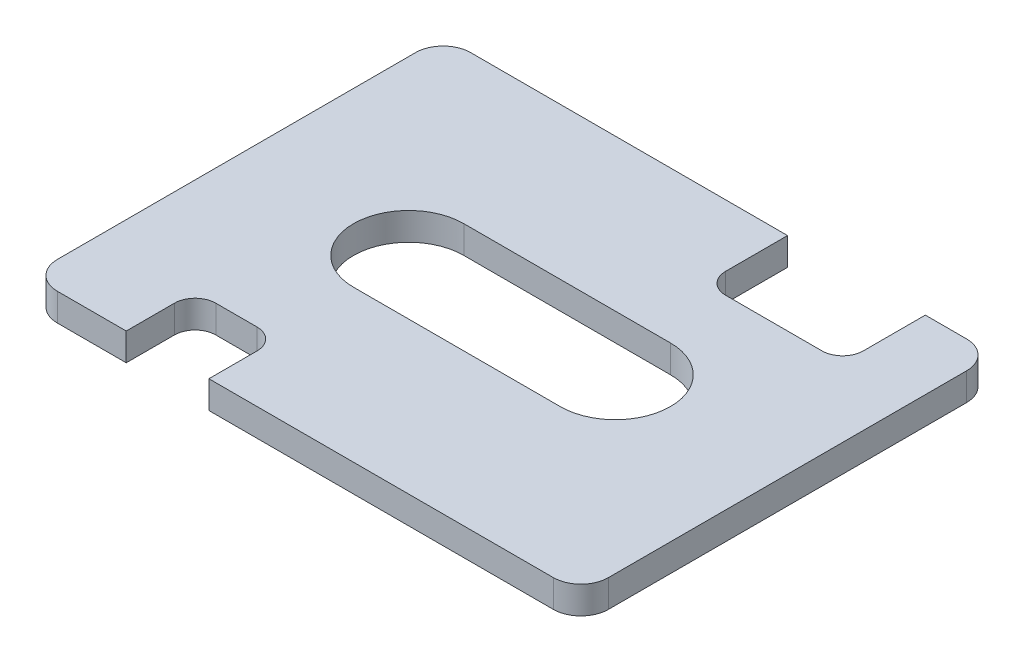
ISO-10303-21;
HEADER;
FILE_DESCRIPTION(('STEP AP214'),'2;1');
FILE_NAME('part.step','',(''),(''),'','','');
FILE_SCHEMA(('AUTOMOTIVE_DESIGN { 1 0 10303 214 1 1 1 1 }'));
ENDSEC;
DATA;
#1=APPLICATION_CONTEXT('core data for automotive mechanical design processes');
#2=APPLICATION_PROTOCOL_DEFINITION('international standard','automotive_design',2000,#1);
#3=PRODUCT_CONTEXT('',#1,'mechanical');
#4=PRODUCT('Part','Part','',(#3));
#5=PRODUCT_RELATED_PRODUCT_CATEGORY('part','',(#4));
#6=PRODUCT_DEFINITION_FORMATION('','',#4);
#7=PRODUCT_DEFINITION_CONTEXT('part definition',#1,'design');
#8=PRODUCT_DEFINITION('design','',#6,#7);
#9=PRODUCT_DEFINITION_SHAPE('','',#8);
#10=(LENGTH_UNIT() NAMED_UNIT(*) SI_UNIT(.MILLI.,.METRE.));
#11=(NAMED_UNIT(*) PLANE_ANGLE_UNIT() SI_UNIT($,.RADIAN.));
#12=(NAMED_UNIT(*) SI_UNIT($,.STERADIAN.) SOLID_ANGLE_UNIT());
#13=UNCERTAINTY_MEASURE_WITH_UNIT(LENGTH_MEASURE(1.E-05),#10,'distance_accuracy_value','');
#14=(GEOMETRIC_REPRESENTATION_CONTEXT(3) GLOBAL_UNCERTAINTY_ASSIGNED_CONTEXT((#13)) GLOBAL_UNIT_ASSIGNED_CONTEXT((#10,
#11,#12)) REPRESENTATION_CONTEXT('',''));
#15=CARTESIAN_POINT('',(0.,0.,0.));
#16=DIRECTION('',(0.,0.,1.));
#17=DIRECTION('',(1.,0.,0.));
#18=AXIS2_PLACEMENT_3D('',#15,#16,#17);
#19=CARTESIAN_POINT('',(-100.,10.,-75.));
#20=DIRECTION('',(0.,0.,1.));
#21=DIRECTION('',(1.,0.,0.));
#22=AXIS2_PLACEMENT_3D('',#19,#20,#21);
#23=PLANE('',#22);
#24=DIRECTION('',(-1.,0.,0.));
#25=VECTOR('',#24,1.);
#26=CARTESIAN_POINT('',(-100.,0.,-75.));
#27=LINE('',#26,#25);
#28=CARTESIAN_POINT('',(25.,0.,-75.));
#29=VERTEX_POINT('',#28);
#30=CARTESIAN_POINT('',(-90.,0.,-75.));
#31=VERTEX_POINT('',#30);
#32=EDGE_CURVE('E516',#29,#31,#27,.T.);
#33=ORIENTED_EDGE('',*,*,#32,.T.);
#34=DIRECTION('',(0.,-1.,0.));
#35=VECTOR('',#34,1.);
#36=CARTESIAN_POINT('',(-90.,10.,-75.));
#37=LINE('',#36,#35);
#38=CARTESIAN_POINT('',(-90.,10.,-75.));
#39=VERTEX_POINT('',#38);
#40=EDGE_CURVE('E442',#31,#39,#37,.F.);
#41=ORIENTED_EDGE('',*,*,#40,.T.);
#42=DIRECTION('',(-1.,0.,0.));
#43=VECTOR('',#42,1.);
#44=CARTESIAN_POINT('',(-100.,10.,-75.));
#45=LINE('',#44,#43);
#46=CARTESIAN_POINT('',(25.,10.,-75.));
#47=VERTEX_POINT('',#46);
#48=EDGE_CURVE('E410',#47,#39,#45,.T.);
#49=ORIENTED_EDGE('',*,*,#48,.F.);
#50=DIRECTION('',(0.,-1.,0.));
#51=VECTOR('',#50,1.);
#52=CARTESIAN_POINT('',(25.,10.,-75.));
#53=LINE('',#52,#51);
#54=EDGE_CURVE('E301',#47,#29,#53,.T.);
#55=ORIENTED_EDGE('',*,*,#54,.T.);
#56=EDGE_LOOP('',(#33,#41,#49,#55));
#57=FACE_BOUND('',#56,.T.);
#58=ADVANCED_FACE('F41',(#57),#23,.F.);
#59=CARTESIAN_POINT('',(-100.,10.,75.));
#60=DIRECTION('',(0.,0.,-1.));
#61=DIRECTION('',(-1.,0.,0.));
#62=AXIS2_PLACEMENT_3D('',#59,#60,#61);
#63=PLANE('',#62);
#64=DIRECTION('',(1.,0.,0.));
#65=VECTOR('',#64,1.);
#66=CARTESIAN_POINT('',(-100.,0.,75.));
#67=LINE('',#66,#65);
#68=CARTESIAN_POINT('',(-35.,0.,75.));
#69=VERTEX_POINT('',#68);
#70=CARTESIAN_POINT('',(90.,0.,75.));
#71=VERTEX_POINT('',#70);
#72=EDGE_CURVE('E429',#69,#71,#67,.T.);
#73=ORIENTED_EDGE('',*,*,#72,.T.);
#74=DIRECTION('',(0.,-1.,0.));
#75=VECTOR('',#74,1.);
#76=CARTESIAN_POINT('',(90.,10.,75.));
#77=LINE('',#76,#75);
#78=CARTESIAN_POINT('',(90.,10.,75.));
#79=VERTEX_POINT('',#78);
#80=EDGE_CURVE('E51',#71,#79,#77,.F.);
#81=ORIENTED_EDGE('',*,*,#80,.T.);
#82=DIRECTION('',(1.,0.,0.));
#83=VECTOR('',#82,1.);
#84=CARTESIAN_POINT('',(-100.,10.,75.));
#85=LINE('',#84,#83);
#86=CARTESIAN_POINT('',(-35.,10.,75.));
#87=VERTEX_POINT('',#86);
#88=EDGE_CURVE('E427',#87,#79,#85,.T.);
#89=ORIENTED_EDGE('',*,*,#88,.F.);
#90=DIRECTION('',(0.,-1.,0.));
#91=VECTOR('',#90,1.);
#92=CARTESIAN_POINT('',(-35.,10.,75.));
#93=LINE('',#92,#91);
#94=EDGE_CURVE('E498',#87,#69,#93,.T.);
#95=ORIENTED_EDGE('',*,*,#94,.T.);
#96=EDGE_LOOP('',(#73,#81,#89,#95));
#97=FACE_BOUND('',#96,.T.);
#98=ADVANCED_FACE('F379',(#97),#63,.F.);
#99=CARTESIAN_POINT('',(100.,10.,75.));
#100=DIRECTION('',(-1.,0.,0.));
#101=DIRECTION('',(0.,0.,1.));
#102=AXIS2_PLACEMENT_3D('',#99,#100,#101);
#103=PLANE('',#102);
#104=DIRECTION('',(0.,0.,-1.));
#105=VECTOR('',#104,1.);
#106=CARTESIAN_POINT('',(100.,0.,75.));
#107=LINE('',#106,#105);
#108=CARTESIAN_POINT('',(100.,0.,65.));
#109=VERTEX_POINT('',#108);
#110=CARTESIAN_POINT('',(100.,0.,-65.));
#111=VERTEX_POINT('',#110);
#112=EDGE_CURVE('E502',#109,#111,#107,.T.);
#113=ORIENTED_EDGE('',*,*,#112,.T.);
#114=DIRECTION('',(0.,-1.,0.));
#115=VECTOR('',#114,1.);
#116=CARTESIAN_POINT('',(100.,10.,-65.));
#117=LINE('',#116,#115);
#118=CARTESIAN_POINT('',(100.,10.,-65.));
#119=VERTEX_POINT('',#118);
#120=EDGE_CURVE('E66',#111,#119,#117,.F.);
#121=ORIENTED_EDGE('',*,*,#120,.T.);
#122=DIRECTION('',(0.,0.,-1.));
#123=VECTOR('',#122,1.);
#124=CARTESIAN_POINT('',(100.,10.,75.));
#125=LINE('',#124,#123);
#126=CARTESIAN_POINT('',(100.,10.,65.));
#127=VERTEX_POINT('',#126);
#128=EDGE_CURVE('E503',#127,#119,#125,.T.);
#129=ORIENTED_EDGE('',*,*,#128,.F.);
#130=DIRECTION('',(0.,-1.,0.));
#131=VECTOR('',#130,1.);
#132=CARTESIAN_POINT('',(100.,10.,65.));
#133=LINE('',#132,#131);
#134=EDGE_CURVE('E414',#127,#109,#133,.T.);
#135=ORIENTED_EDGE('',*,*,#134,.T.);
#136=EDGE_LOOP('',(#113,#121,#129,#135));
#137=FACE_BOUND('',#136,.T.);
#138=ADVANCED_FACE('F386',(#137),#103,.F.);
#139=CARTESIAN_POINT('',(90.,10.,-75.));
#140=VERTEX_POINT('',#139);
#141=CARTESIAN_POINT('',(75.,10.,-75.));
#142=VERTEX_POINT('',#141);
#143=EDGE_CURVE('E402',#140,#142,#45,.T.);
#144=ORIENTED_EDGE('',*,*,#143,.F.);
#145=DIRECTION('',(0.,-1.,0.));
#146=VECTOR('',#145,1.);
#147=CARTESIAN_POINT('',(90.,10.,-75.));
#148=LINE('',#147,#146);
#149=CARTESIAN_POINT('',(90.,0.,-75.));
#150=VERTEX_POINT('',#149);
#151=EDGE_CURVE('E404',#140,#150,#148,.T.);
#152=ORIENTED_EDGE('',*,*,#151,.T.);
#153=CARTESIAN_POINT('',(75.,0.,-75.));
#154=VERTEX_POINT('',#153);
#155=EDGE_CURVE('E517',#150,#154,#27,.T.);
#156=ORIENTED_EDGE('',*,*,#155,.T.);
#157=DIRECTION('',(0.,1.,0.));
#158=VECTOR('',#157,1.);
#159=CARTESIAN_POINT('',(75.,10.,-75.));
#160=LINE('',#159,#158);
#161=EDGE_CURVE('E264',#154,#142,#160,.T.);
#162=ORIENTED_EDGE('',*,*,#161,.T.);
#163=EDGE_LOOP('',(#144,#152,#156,#162));
#164=FACE_BOUND('',#163,.T.);
#165=ADVANCED_FACE('F382',(#164),#23,.F.);
#166=CARTESIAN_POINT('',(-100.,10.,75.));
#167=DIRECTION('',(1.,0.,0.));
#168=DIRECTION('',(0.,0.,-1.));
#169=AXIS2_PLACEMENT_3D('',#166,#167,#168);
#170=PLANE('',#169);
#171=DIRECTION('',(0.,0.,1.));
#172=VECTOR('',#171,1.);
#173=CARTESIAN_POINT('',(-100.,10.,75.));
#174=LINE('',#173,#172);
#175=CARTESIAN_POINT('',(-100.,10.,-65.));
#176=VERTEX_POINT('',#175);
#177=CARTESIAN_POINT('',(-100.,10.,65.));
#178=VERTEX_POINT('',#177);
#179=EDGE_CURVE('E409',#176,#178,#174,.T.);
#180=ORIENTED_EDGE('',*,*,#179,.F.);
#181=DIRECTION('',(0.,-1.,0.));
#182=VECTOR('',#181,1.);
#183=CARTESIAN_POINT('',(-100.,10.,-65.));
#184=LINE('',#183,#182);
#185=CARTESIAN_POINT('',(-100.,0.,-65.));
#186=VERTEX_POINT('',#185);
#187=EDGE_CURVE('E453',#176,#186,#184,.T.);
#188=ORIENTED_EDGE('',*,*,#187,.T.);
#189=DIRECTION('',(0.,0.,1.));
#190=VECTOR('',#189,1.);
#191=CARTESIAN_POINT('',(-100.,0.,75.));
#192=LINE('',#191,#190);
#193=CARTESIAN_POINT('',(-100.,0.,65.));
#194=VERTEX_POINT('',#193);
#195=EDGE_CURVE('E519',#186,#194,#192,.T.);
#196=ORIENTED_EDGE('',*,*,#195,.T.);
#197=DIRECTION('',(0.,-1.,0.));
#198=VECTOR('',#197,1.);
#199=CARTESIAN_POINT('',(-100.,10.,65.));
#200=LINE('',#199,#198);
#201=EDGE_CURVE('E455',#194,#178,#200,.F.);
#202=ORIENTED_EDGE('',*,*,#201,.T.);
#203=EDGE_LOOP('',(#180,#188,#196,#202));
#204=FACE_BOUND('',#203,.T.);
#205=ADVANCED_FACE('F394',(#204),#170,.F.);
#206=CARTESIAN_POINT('',(-90.,10.,75.));
#207=VERTEX_POINT('',#206);
#208=CARTESIAN_POINT('',(-65.,10.,75.));
#209=VERTEX_POINT('',#208);
#210=EDGE_CURVE('E436',#207,#209,#85,.T.);
#211=ORIENTED_EDGE('',*,*,#210,.F.);
#212=DIRECTION('',(0.,-1.,0.));
#213=VECTOR('',#212,1.);
#214=CARTESIAN_POINT('',(-90.,10.,75.));
#215=LINE('',#214,#213);
#216=CARTESIAN_POINT('',(-90.,0.,75.));
#217=VERTEX_POINT('',#216);
#218=EDGE_CURVE('E12',#207,#217,#215,.T.);
#219=ORIENTED_EDGE('',*,*,#218,.T.);
#220=CARTESIAN_POINT('',(-65.,0.,75.));
#221=VERTEX_POINT('',#220);
#222=EDGE_CURVE('E505',#217,#221,#67,.T.);
#223=ORIENTED_EDGE('',*,*,#222,.T.);
#224=DIRECTION('',(0.,1.,0.));
#225=VECTOR('',#224,1.);
#226=CARTESIAN_POINT('',(-65.,10.,75.));
#227=LINE('',#226,#225);
#228=EDGE_CURVE('E477',#221,#209,#227,.T.);
#229=ORIENTED_EDGE('',*,*,#228,.T.);
#230=EDGE_LOOP('',(#211,#219,#223,#229));
#231=FACE_BOUND('',#230,.T.);
#232=ADVANCED_FACE('F389',(#231),#63,.F.);
#233=CARTESIAN_POINT('',(0.,10.,0.));
#234=DIRECTION('',(0.,-1.,0.));
#235=DIRECTION('',(0.,0.,-1.));
#236=AXIS2_PLACEMENT_3D('',#233,#234,#235);
#237=PLANE('',#236);
#238=DIRECTION('',(1.,0.,0.));
#239=VECTOR('',#238,1.);
#240=CARTESIAN_POINT('',(-37.5,10.,20.));
#241=LINE('',#240,#239);
#242=CARTESIAN_POINT('',(-37.5,10.,20.));
#243=VERTEX_POINT('',#242);
#244=CARTESIAN_POINT('',(37.5,10.,20.));
#245=VERTEX_POINT('',#244);
#246=EDGE_CURVE('E351',#243,#245,#241,.T.);
#247=ORIENTED_EDGE('',*,*,#246,.F.);
#248=CARTESIAN_POINT('',(-37.5,10.,0.));
#249=DIRECTION('',(0.,1.,0.));
#250=DIRECTION('',(0.,0.,1.));
#251=AXIS2_PLACEMENT_3D('',#248,#249,#250);
#252=CIRCLE('',#251,20.);
#253=CARTESIAN_POINT('',(-37.5,10.,-20.));
#254=VERTEX_POINT('',#253);
#255=EDGE_CURVE('E213',#254,#243,#252,.T.);
#256=ORIENTED_EDGE('',*,*,#255,.F.);
#257=DIRECTION('',(-1.,0.,0.));
#258=VECTOR('',#257,1.);
#259=CARTESIAN_POINT('',(-37.5,10.,-20.));
#260=LINE('',#259,#258);
#261=CARTESIAN_POINT('',(37.5,10.,-20.));
#262=VERTEX_POINT('',#261);
#263=EDGE_CURVE('E232',#262,#254,#260,.T.);
#264=ORIENTED_EDGE('',*,*,#263,.F.);
#265=CARTESIAN_POINT('',(37.5,10.,0.));
#266=DIRECTION('',(0.,1.,0.));
#267=DIRECTION('',(0.,0.,1.));
#268=AXIS2_PLACEMENT_3D('',#265,#266,#267);
#269=CIRCLE('',#268,20.);
#270=EDGE_CURVE('E238',#245,#262,#269,.T.);
#271=ORIENTED_EDGE('',*,*,#270,.F.);
#272=EDGE_LOOP('',(#247,#256,#264,#271));
#273=FACE_BOUND('',#272,.T.);
#274=ORIENTED_EDGE('',*,*,#48,.T.);
#275=CARTESIAN_POINT('',(-90.,10.,-65.));
#276=DIRECTION('',(0.,-1.,0.));
#277=DIRECTION('',(0.,0.,-1.));
#278=AXIS2_PLACEMENT_3D('',#275,#276,#277);
#279=CIRCLE('',#278,10.);
#280=EDGE_CURVE('E415',#39,#176,#279,.F.);
#281=ORIENTED_EDGE('',*,*,#280,.T.);
#282=ORIENTED_EDGE('',*,*,#179,.T.);
#283=CARTESIAN_POINT('',(-90.,10.,65.));
#284=DIRECTION('',(0.,-1.,0.));
#285=DIRECTION('',(0.,0.,-1.));
#286=AXIS2_PLACEMENT_3D('',#283,#284,#285);
#287=CIRCLE('',#286,10.);
#288=EDGE_CURVE('E440',#178,#207,#287,.F.);
#289=ORIENTED_EDGE('',*,*,#288,.T.);
#290=ORIENTED_EDGE('',*,*,#210,.T.);
#291=DIRECTION('',(0.,0.,1.));
#292=VECTOR('',#291,1.);
#293=CARTESIAN_POINT('',(-65.,10.,100.));
#294=LINE('',#293,#292);
#295=CARTESIAN_POINT('',(-65.,10.,57.5));
#296=VERTEX_POINT('',#295);
#297=EDGE_CURVE('E312',#296,#209,#294,.T.);
#298=ORIENTED_EDGE('',*,*,#297,.F.);
#299=CARTESIAN_POINT('',(-57.5,10.,57.5));
#300=DIRECTION('',(0.,-1.,0.));
#301=DIRECTION('',(0.,0.,-1.));
#302=AXIS2_PLACEMENT_3D('',#299,#300,#301);
#303=CIRCLE('',#302,7.5);
#304=CARTESIAN_POINT('',(-57.5,10.,50.));
#305=VERTEX_POINT('',#304);
#306=EDGE_CURVE('E329',#296,#305,#303,.T.);
#307=ORIENTED_EDGE('',*,*,#306,.T.);
#308=DIRECTION('',(-1.,0.,0.));
#309=VECTOR('',#308,1.);
#310=CARTESIAN_POINT('',(-65.,10.,50.));
#311=LINE('',#310,#309);
#312=CARTESIAN_POINT('',(-42.5,10.,50.));
#313=VERTEX_POINT('',#312);
#314=EDGE_CURVE('E566',#313,#305,#311,.T.);
#315=ORIENTED_EDGE('',*,*,#314,.F.);
#316=CARTESIAN_POINT('',(-42.5,10.,57.5));
#317=DIRECTION('',(0.,-1.,0.));
#318=DIRECTION('',(0.,0.,-1.));
#319=AXIS2_PLACEMENT_3D('',#316,#317,#318);
#320=CIRCLE('',#319,7.5);
#321=CARTESIAN_POINT('',(-35.,10.,57.5));
#322=VERTEX_POINT('',#321);
#323=EDGE_CURVE('E321',#313,#322,#320,.T.);
#324=ORIENTED_EDGE('',*,*,#323,.T.);
#325=DIRECTION('',(0.,0.,-1.));
#326=VECTOR('',#325,1.);
#327=CARTESIAN_POINT('',(-35.,10.,100.));
#328=LINE('',#327,#326);
#329=EDGE_CURVE('E306',#87,#322,#328,.T.);
#330=ORIENTED_EDGE('',*,*,#329,.F.);
#331=ORIENTED_EDGE('',*,*,#88,.T.);
#332=CARTESIAN_POINT('',(90.,10.,65.));
#333=DIRECTION('',(0.,-1.,0.));
#334=DIRECTION('',(0.,0.,-1.));
#335=AXIS2_PLACEMENT_3D('',#332,#333,#334);
#336=CIRCLE('',#335,10.);
#337=EDGE_CURVE('E434',#79,#127,#336,.F.);
#338=ORIENTED_EDGE('',*,*,#337,.T.);
#339=ORIENTED_EDGE('',*,*,#128,.T.);
#340=CARTESIAN_POINT('',(90.,10.,-65.));
#341=DIRECTION('',(0.,-1.,0.));
#342=DIRECTION('',(0.,0.,-1.));
#343=AXIS2_PLACEMENT_3D('',#340,#341,#342);
#344=CIRCLE('',#343,10.);
#345=EDGE_CURVE('E58',#119,#140,#344,.F.);
#346=ORIENTED_EDGE('',*,*,#345,.T.);
#347=ORIENTED_EDGE('',*,*,#143,.T.);
#348=DIRECTION('',(0.,0.,-1.));
#349=VECTOR('',#348,1.);
#350=CARTESIAN_POINT('',(75.,10.,-105.));
#351=LINE('',#350,#349);
#352=CARTESIAN_POINT('',(75.,10.,-52.5));
#353=VERTEX_POINT('',#352);
#354=EDGE_CURVE('E257',#353,#142,#351,.T.);
#355=ORIENTED_EDGE('',*,*,#354,.F.);
#356=CARTESIAN_POINT('',(67.5,10.,-52.5));
#357=DIRECTION('',(0.,-1.,0.));
#358=DIRECTION('',(0.,0.,-1.));
#359=AXIS2_PLACEMENT_3D('',#356,#357,#358);
#360=CIRCLE('',#359,7.5);
#361=CARTESIAN_POINT('',(67.5,10.,-45.));
#362=VERTEX_POINT('',#361);
#363=EDGE_CURVE('E479',#353,#362,#360,.T.);
#364=ORIENTED_EDGE('',*,*,#363,.T.);
#365=DIRECTION('',(1.,0.,0.));
#366=VECTOR('',#365,1.);
#367=CARTESIAN_POINT('',(75.,10.,-45.));
#368=LINE('',#367,#366);
#369=CARTESIAN_POINT('',(32.5,10.,-45.));
#370=VERTEX_POINT('',#369);
#371=EDGE_CURVE('E540',#370,#362,#368,.T.);
#372=ORIENTED_EDGE('',*,*,#371,.F.);
#373=CARTESIAN_POINT('',(32.5,10.,-52.5));
#374=DIRECTION('',(0.,-1.,0.));
#375=DIRECTION('',(0.,0.,-1.));
#376=AXIS2_PLACEMENT_3D('',#373,#374,#375);
#377=CIRCLE('',#376,7.5);
#378=CARTESIAN_POINT('',(25.,10.,-52.5));
#379=VERTEX_POINT('',#378);
#380=EDGE_CURVE('E539',#370,#379,#377,.T.);
#381=ORIENTED_EDGE('',*,*,#380,.T.);
#382=DIRECTION('',(0.,0.,1.));
#383=VECTOR('',#382,1.);
#384=CARTESIAN_POINT('',(25.,10.,-105.));
#385=LINE('',#384,#383);
#386=EDGE_CURVE('E265',#47,#379,#385,.T.);
#387=ORIENTED_EDGE('',*,*,#386,.F.);
#388=EDGE_LOOP('',(#274,#281,#282,#289,#290,#298,#307,#315,#324,#330,#331,#338,#339,#346,#347,
#355,#364,#372,#381,#387));
#389=FACE_BOUND('',#388,.T.);
#390=ADVANCED_FACE('F354',(#273,#389),#237,.F.);
#391=CARTESIAN_POINT('',(0.,0.,0.));
#392=DIRECTION('',(0.,-1.,0.));
#393=DIRECTION('',(0.,0.,-1.));
#394=AXIS2_PLACEMENT_3D('',#391,#392,#393);
#395=PLANE('',#394);
#396=CARTESIAN_POINT('',(-37.5,0.,0.));
#397=DIRECTION('',(0.,1.,0.));
#398=DIRECTION('',(0.,0.,1.));
#399=AXIS2_PLACEMENT_3D('',#396,#397,#398);
#400=CIRCLE('',#399,20.);
#401=CARTESIAN_POINT('',(-37.5,0.,-20.));
#402=VERTEX_POINT('',#401);
#403=CARTESIAN_POINT('',(-37.5,0.,20.));
#404=VERTEX_POINT('',#403);
#405=EDGE_CURVE('E210',#402,#404,#400,.T.);
#406=ORIENTED_EDGE('',*,*,#405,.T.);
#407=DIRECTION('',(1.,0.,0.));
#408=VECTOR('',#407,1.);
#409=CARTESIAN_POINT('',(-37.5,0.,20.));
#410=LINE('',#409,#408);
#411=CARTESIAN_POINT('',(37.5,0.,20.));
#412=VERTEX_POINT('',#411);
#413=EDGE_CURVE('E222',#404,#412,#410,.T.);
#414=ORIENTED_EDGE('',*,*,#413,.T.);
#415=CARTESIAN_POINT('',(37.5,0.,0.));
#416=DIRECTION('',(0.,1.,0.));
#417=DIRECTION('',(0.,0.,1.));
#418=AXIS2_PLACEMENT_3D('',#415,#416,#417);
#419=CIRCLE('',#418,20.);
#420=CARTESIAN_POINT('',(37.5,0.,-20.));
#421=VERTEX_POINT('',#420);
#422=EDGE_CURVE('E226',#412,#421,#419,.T.);
#423=ORIENTED_EDGE('',*,*,#422,.T.);
#424=DIRECTION('',(-1.,0.,0.));
#425=VECTOR('',#424,1.);
#426=CARTESIAN_POINT('',(-37.5,0.,-20.));
#427=LINE('',#426,#425);
#428=EDGE_CURVE('E218',#421,#402,#427,.T.);
#429=ORIENTED_EDGE('',*,*,#428,.T.);
#430=EDGE_LOOP('',(#406,#414,#423,#429));
#431=FACE_BOUND('',#430,.T.);
#432=ORIENTED_EDGE('',*,*,#195,.F.);
#433=CARTESIAN_POINT('',(-90.,0.,-65.));
#434=DIRECTION('',(0.,-1.,0.));
#435=DIRECTION('',(0.,0.,-1.));
#436=AXIS2_PLACEMENT_3D('',#433,#434,#435);
#437=CIRCLE('',#436,10.);
#438=EDGE_CURVE('E446',#186,#31,#437,.T.);
#439=ORIENTED_EDGE('',*,*,#438,.T.);
#440=ORIENTED_EDGE('',*,*,#32,.F.);
#441=DIRECTION('',(0.,0.,-1.));
#442=VECTOR('',#441,1.);
#443=CARTESIAN_POINT('',(25.,0.,0.));
#444=LINE('',#443,#442);
#445=CARTESIAN_POINT('',(25.,0.,-52.5));
#446=VERTEX_POINT('',#445);
#447=EDGE_CURVE('E275',#446,#29,#444,.T.);
#448=ORIENTED_EDGE('',*,*,#447,.F.);
#449=CARTESIAN_POINT('',(32.5,0.,-52.5));
#450=DIRECTION('',(0.,-1.,0.));
#451=DIRECTION('',(0.,0.,-1.));
#452=AXIS2_PLACEMENT_3D('',#449,#450,#451);
#453=CIRCLE('',#452,7.5);
#454=CARTESIAN_POINT('',(32.5,0.,-45.));
#455=VERTEX_POINT('',#454);
#456=EDGE_CURVE('E326',#446,#455,#453,.F.);
#457=ORIENTED_EDGE('',*,*,#456,.T.);
#458=DIRECTION('',(1.,0.,0.));
#459=VECTOR('',#458,1.);
#460=CARTESIAN_POINT('',(75.,0.,-45.));
#461=LINE('',#460,#459);
#462=CARTESIAN_POINT('',(67.5,0.,-45.));
#463=VERTEX_POINT('',#462);
#464=EDGE_CURVE('E252',#455,#463,#461,.T.);
#465=ORIENTED_EDGE('',*,*,#464,.T.);
#466=CARTESIAN_POINT('',(67.5,0.,-52.5));
#467=DIRECTION('',(0.,-1.,0.));
#468=DIRECTION('',(0.,0.,-1.));
#469=AXIS2_PLACEMENT_3D('',#466,#467,#468);
#470=CIRCLE('',#469,7.5);
#471=CARTESIAN_POINT('',(75.,0.,-52.5));
#472=VERTEX_POINT('',#471);
#473=EDGE_CURVE('E482',#463,#472,#470,.F.);
#474=ORIENTED_EDGE('',*,*,#473,.T.);
#475=DIRECTION('',(0.,0.,-1.));
#476=VECTOR('',#475,1.);
#477=CARTESIAN_POINT('',(75.,0.,-105.));
#478=LINE('',#477,#476);
#479=EDGE_CURVE('E256',#472,#154,#478,.T.);
#480=ORIENTED_EDGE('',*,*,#479,.T.);
#481=ORIENTED_EDGE('',*,*,#155,.F.);
#482=CARTESIAN_POINT('',(90.,0.,-65.));
#483=DIRECTION('',(0.,-1.,0.));
#484=DIRECTION('',(0.,0.,-1.));
#485=AXIS2_PLACEMENT_3D('',#482,#483,#484);
#486=CIRCLE('',#485,10.);
#487=EDGE_CURVE('E413',#150,#111,#486,.T.);
#488=ORIENTED_EDGE('',*,*,#487,.T.);
#489=ORIENTED_EDGE('',*,*,#112,.F.);
#490=CARTESIAN_POINT('',(90.,0.,65.));
#491=DIRECTION('',(0.,-1.,0.));
#492=DIRECTION('',(0.,0.,-1.));
#493=AXIS2_PLACEMENT_3D('',#490,#491,#492);
#494=CIRCLE('',#493,10.);
#495=EDGE_CURVE('E449',#109,#71,#494,.T.);
#496=ORIENTED_EDGE('',*,*,#495,.T.);
#497=ORIENTED_EDGE('',*,*,#72,.F.);
#498=DIRECTION('',(0.,0.,1.));
#499=VECTOR('',#498,1.);
#500=CARTESIAN_POINT('',(-35.,0.,0.));
#501=LINE('',#500,#499);
#502=CARTESIAN_POINT('',(-35.,0.,57.5));
#503=VERTEX_POINT('',#502);
#504=EDGE_CURVE('E280',#503,#69,#501,.T.);
#505=ORIENTED_EDGE('',*,*,#504,.F.);
#506=CARTESIAN_POINT('',(-42.5,0.,57.5));
#507=DIRECTION('',(0.,-1.,0.));
#508=DIRECTION('',(0.,0.,-1.));
#509=AXIS2_PLACEMENT_3D('',#506,#507,#508);
#510=CIRCLE('',#509,7.5);
#511=CARTESIAN_POINT('',(-42.5,0.,50.));
#512=VERTEX_POINT('',#511);
#513=EDGE_CURVE('E325',#503,#512,#510,.F.);
#514=ORIENTED_EDGE('',*,*,#513,.T.);
#515=DIRECTION('',(-1.,0.,0.));
#516=VECTOR('',#515,1.);
#517=CARTESIAN_POINT('',(-65.,0.,50.));
#518=LINE('',#517,#516);
#519=CARTESIAN_POINT('',(-57.5,0.,50.));
#520=VERTEX_POINT('',#519);
#521=EDGE_CURVE('E307',#512,#520,#518,.T.);
#522=ORIENTED_EDGE('',*,*,#521,.T.);
#523=CARTESIAN_POINT('',(-57.5,0.,57.5));
#524=DIRECTION('',(0.,-1.,0.));
#525=DIRECTION('',(0.,0.,-1.));
#526=AXIS2_PLACEMENT_3D('',#523,#524,#525);
#527=CIRCLE('',#526,7.5);
#528=CARTESIAN_POINT('',(-65.,0.,57.5));
#529=VERTEX_POINT('',#528);
#530=EDGE_CURVE('E332',#520,#529,#527,.F.);
#531=ORIENTED_EDGE('',*,*,#530,.T.);
#532=DIRECTION('',(0.,0.,1.));
#533=VECTOR('',#532,1.);
#534=CARTESIAN_POINT('',(-65.,0.,100.));
#535=LINE('',#534,#533);
#536=EDGE_CURVE('E311',#529,#221,#535,.T.);
#537=ORIENTED_EDGE('',*,*,#536,.T.);
#538=ORIENTED_EDGE('',*,*,#222,.F.);
#539=CARTESIAN_POINT('',(-90.,0.,65.));
#540=DIRECTION('',(0.,-1.,0.));
#541=DIRECTION('',(0.,0.,-1.));
#542=AXIS2_PLACEMENT_3D('',#539,#540,#541);
#543=CIRCLE('',#542,10.);
#544=EDGE_CURVE('E451',#217,#194,#543,.T.);
#545=ORIENTED_EDGE('',*,*,#544,.T.);
#546=EDGE_LOOP('',(#432,#439,#440,#448,#457,#465,#474,#480,#481,#488,#489,#496,#497,#505,#514,
#522,#531,#537,#538,#545));
#547=FACE_BOUND('',#546,.T.);
#548=ADVANCED_FACE('F228',(#431,#547),#395,.T.);
#549=CARTESIAN_POINT('',(-35.,0.,100.));
#550=DIRECTION('',(1.,0.,0.));
#551=DIRECTION('',(0.,0.,-1.));
#552=AXIS2_PLACEMENT_3D('',#549,#550,#551);
#553=PLANE('',#552);
#554=ORIENTED_EDGE('',*,*,#329,.T.);
#555=DIRECTION('',(0.,1.,0.));
#556=VECTOR('',#555,1.);
#557=CARTESIAN_POINT('',(-35.,0.,57.5));
#558=LINE('',#557,#556);
#559=EDGE_CURVE('E480',#322,#503,#558,.F.);
#560=ORIENTED_EDGE('',*,*,#559,.T.);
#561=ORIENTED_EDGE('',*,*,#504,.T.);
#562=ORIENTED_EDGE('',*,*,#94,.F.);
#563=EDGE_LOOP('',(#554,#560,#561,#562));
#564=FACE_BOUND('',#563,.T.);
#565=ADVANCED_FACE('F577',(#564),#553,.F.);
#566=CARTESIAN_POINT('',(-65.,0.,100.));
#567=DIRECTION('',(-1.,0.,0.));
#568=DIRECTION('',(0.,0.,1.));
#569=AXIS2_PLACEMENT_3D('',#566,#567,#568);
#570=PLANE('',#569);
#571=ORIENTED_EDGE('',*,*,#536,.F.);
#572=DIRECTION('',(0.,1.,0.));
#573=VECTOR('',#572,1.);
#574=CARTESIAN_POINT('',(-65.,10.,57.5));
#575=LINE('',#574,#573);
#576=EDGE_CURVE('E474',#529,#296,#575,.T.);
#577=ORIENTED_EDGE('',*,*,#576,.T.);
#578=ORIENTED_EDGE('',*,*,#297,.T.);
#579=ORIENTED_EDGE('',*,*,#228,.F.);
#580=EDGE_LOOP('',(#571,#577,#578,#579));
#581=FACE_BOUND('',#580,.T.);
#582=ADVANCED_FACE('F472',(#581),#570,.F.);
#583=CARTESIAN_POINT('',(-65.,0.,50.));
#584=DIRECTION('',(0.,0.,-1.));
#585=DIRECTION('',(-1.,0.,0.));
#586=AXIS2_PLACEMENT_3D('',#583,#584,#585);
#587=PLANE('',#586);
#588=ORIENTED_EDGE('',*,*,#521,.F.);
#589=DIRECTION('',(0.,1.,0.));
#590=VECTOR('',#589,1.);
#591=CARTESIAN_POINT('',(-42.5,10.,50.));
#592=LINE('',#591,#590);
#593=EDGE_CURVE('E484',#512,#313,#592,.T.);
#594=ORIENTED_EDGE('',*,*,#593,.T.);
#595=ORIENTED_EDGE('',*,*,#314,.T.);
#596=DIRECTION('',(0.,1.,0.));
#597=VECTOR('',#596,1.);
#598=CARTESIAN_POINT('',(-57.5,0.,50.));
#599=LINE('',#598,#597);
#600=EDGE_CURVE('E556',#305,#520,#599,.F.);
#601=ORIENTED_EDGE('',*,*,#600,.T.);
#602=EDGE_LOOP('',(#588,#594,#595,#601));
#603=FACE_BOUND('',#602,.T.);
#604=ADVANCED_FACE('F565',(#603),#587,.F.);
#605=CARTESIAN_POINT('',(25.,0.,-105.));
#606=DIRECTION('',(-1.,0.,0.));
#607=DIRECTION('',(0.,0.,1.));
#608=AXIS2_PLACEMENT_3D('',#605,#606,#607);
#609=PLANE('',#608);
#610=ORIENTED_EDGE('',*,*,#386,.T.);
#611=DIRECTION('',(0.,1.,0.));
#612=VECTOR('',#611,1.);
#613=CARTESIAN_POINT('',(25.,0.,-52.5));
#614=LINE('',#613,#612);
#615=EDGE_CURVE('E555',#379,#446,#614,.F.);
#616=ORIENTED_EDGE('',*,*,#615,.T.);
#617=ORIENTED_EDGE('',*,*,#447,.T.);
#618=ORIENTED_EDGE('',*,*,#54,.F.);
#619=EDGE_LOOP('',(#610,#616,#617,#618));
#620=FACE_BOUND('',#619,.T.);
#621=ADVANCED_FACE('F536',(#620),#609,.F.);
#622=CARTESIAN_POINT('',(75.,0.,-105.));
#623=DIRECTION('',(1.,0.,0.));
#624=DIRECTION('',(0.,0.,-1.));
#625=AXIS2_PLACEMENT_3D('',#622,#623,#624);
#626=PLANE('',#625);
#627=ORIENTED_EDGE('',*,*,#479,.F.);
#628=DIRECTION('',(0.,1.,0.));
#629=VECTOR('',#628,1.);
#630=CARTESIAN_POINT('',(75.,10.,-52.5));
#631=LINE('',#630,#629);
#632=EDGE_CURVE('E279',#472,#353,#631,.T.);
#633=ORIENTED_EDGE('',*,*,#632,.T.);
#634=ORIENTED_EDGE('',*,*,#354,.T.);
#635=ORIENTED_EDGE('',*,*,#161,.F.);
#636=EDGE_LOOP('',(#627,#633,#634,#635));
#637=FACE_BOUND('',#636,.T.);
#638=ADVANCED_FACE('F548',(#637),#626,.F.);
#639=CARTESIAN_POINT('',(75.,0.,-45.));
#640=DIRECTION('',(0.,0.,1.));
#641=DIRECTION('',(1.,0.,0.));
#642=AXIS2_PLACEMENT_3D('',#639,#640,#641);
#643=PLANE('',#642);
#644=ORIENTED_EDGE('',*,*,#371,.T.);
#645=DIRECTION('',(0.,1.,0.));
#646=VECTOR('',#645,1.);
#647=CARTESIAN_POINT('',(67.5,0.,-45.));
#648=LINE('',#647,#646);
#649=EDGE_CURVE('E553',#362,#463,#648,.F.);
#650=ORIENTED_EDGE('',*,*,#649,.T.);
#651=ORIENTED_EDGE('',*,*,#464,.F.);
#652=DIRECTION('',(0.,1.,0.));
#653=VECTOR('',#652,1.);
#654=CARTESIAN_POINT('',(32.5,10.,-45.));
#655=LINE('',#654,#653);
#656=EDGE_CURVE('E286',#455,#370,#655,.T.);
#657=ORIENTED_EDGE('',*,*,#656,.T.);
#658=EDGE_LOOP('',(#644,#650,#651,#657));
#659=FACE_BOUND('',#658,.T.);
#660=ADVANCED_FACE('F376',(#659),#643,.F.);
#661=CARTESIAN_POINT('',(-37.5,0.,0.));
#662=DIRECTION('',(0.,1.,0.));
#663=DIRECTION('',(0.,0.,1.));
#664=AXIS2_PLACEMENT_3D('',#661,#662,#663);
#665=CYLINDRICAL_SURFACE('',#664,20.);
#666=ORIENTED_EDGE('',*,*,#255,.T.);
#667=DIRECTION('',(0.,1.,0.));
#668=VECTOR('',#667,1.);
#669=CARTESIAN_POINT('',(-37.5,0.,20.));
#670=LINE('',#669,#668);
#671=EDGE_CURVE('E206',#404,#243,#670,.T.);
#672=ORIENTED_EDGE('',*,*,#671,.F.);
#673=ORIENTED_EDGE('',*,*,#405,.F.);
#674=DIRECTION('',(0.,1.,0.));
#675=VECTOR('',#674,1.);
#676=CARTESIAN_POINT('',(-37.5,0.,-20.));
#677=LINE('',#676,#675);
#678=EDGE_CURVE('E339',#402,#254,#677,.T.);
#679=ORIENTED_EDGE('',*,*,#678,.T.);
#680=EDGE_LOOP('',(#666,#672,#673,#679));
#681=FACE_BOUND('',#680,.T.);
#682=ADVANCED_FACE('F208',(#681),#665,.F.);
#683=CARTESIAN_POINT('',(-37.5,0.,-20.));
#684=DIRECTION('',(0.,0.,-1.));
#685=DIRECTION('',(-1.,0.,0.));
#686=AXIS2_PLACEMENT_3D('',#683,#684,#685);
#687=PLANE('',#686);
#688=ORIENTED_EDGE('',*,*,#263,.T.);
#689=ORIENTED_EDGE('',*,*,#678,.F.);
#690=ORIENTED_EDGE('',*,*,#428,.F.);
#691=DIRECTION('',(0.,1.,0.));
#692=VECTOR('',#691,1.);
#693=CARTESIAN_POINT('',(37.5,0.,-20.));
#694=LINE('',#693,#692);
#695=EDGE_CURVE('E341',#421,#262,#694,.T.);
#696=ORIENTED_EDGE('',*,*,#695,.T.);
#697=EDGE_LOOP('',(#688,#689,#690,#696));
#698=FACE_BOUND('',#697,.T.);
#699=ADVANCED_FACE('F368',(#698),#687,.F.);
#700=CARTESIAN_POINT('',(37.5,0.,0.));
#701=DIRECTION('',(0.,1.,0.));
#702=DIRECTION('',(0.,0.,1.));
#703=AXIS2_PLACEMENT_3D('',#700,#701,#702);
#704=CYLINDRICAL_SURFACE('',#703,20.);
#705=ORIENTED_EDGE('',*,*,#270,.T.);
#706=ORIENTED_EDGE('',*,*,#695,.F.);
#707=ORIENTED_EDGE('',*,*,#422,.F.);
#708=DIRECTION('',(0.,1.,0.));
#709=VECTOR('',#708,1.);
#710=CARTESIAN_POINT('',(37.5,0.,20.));
#711=LINE('',#710,#709);
#712=EDGE_CURVE('E217',#412,#245,#711,.T.);
#713=ORIENTED_EDGE('',*,*,#712,.T.);
#714=EDGE_LOOP('',(#705,#706,#707,#713));
#715=FACE_BOUND('',#714,.T.);
#716=ADVANCED_FACE('F348',(#715),#704,.F.);
#717=CARTESIAN_POINT('',(-37.5,0.,20.));
#718=DIRECTION('',(0.,0.,1.));
#719=DIRECTION('',(1.,0.,0.));
#720=AXIS2_PLACEMENT_3D('',#717,#718,#719);
#721=PLANE('',#720);
#722=ORIENTED_EDGE('',*,*,#246,.T.);
#723=ORIENTED_EDGE('',*,*,#712,.F.);
#724=ORIENTED_EDGE('',*,*,#413,.F.);
#725=ORIENTED_EDGE('',*,*,#671,.T.);
#726=EDGE_LOOP('',(#722,#723,#724,#725));
#727=FACE_BOUND('',#726,.T.);
#728=ADVANCED_FACE('F223',(#727),#721,.F.);
#729=CARTESIAN_POINT('',(67.5,0.,-52.5));
#730=DIRECTION('',(0.,-1.,0.));
#731=DIRECTION('',(0.,0.,-1.));
#732=AXIS2_PLACEMENT_3D('',#729,#730,#731);
#733=CYLINDRICAL_SURFACE('',#732,7.5);
#734=ORIENTED_EDGE('',*,*,#473,.F.);
#735=ORIENTED_EDGE('',*,*,#649,.F.);
#736=ORIENTED_EDGE('',*,*,#363,.F.);
#737=ORIENTED_EDGE('',*,*,#632,.F.);
#738=EDGE_LOOP('',(#734,#735,#736,#737));
#739=FACE_BOUND('',#738,.T.);
#740=ADVANCED_FACE('F552',(#739),#733,.F.);
#741=CARTESIAN_POINT('',(32.5,0.,-52.5));
#742=DIRECTION('',(0.,-1.,0.));
#743=DIRECTION('',(0.,0.,-1.));
#744=AXIS2_PLACEMENT_3D('',#741,#742,#743);
#745=CYLINDRICAL_SURFACE('',#744,7.5);
#746=ORIENTED_EDGE('',*,*,#456,.F.);
#747=ORIENTED_EDGE('',*,*,#615,.F.);
#748=ORIENTED_EDGE('',*,*,#380,.F.);
#749=ORIENTED_EDGE('',*,*,#656,.F.);
#750=EDGE_LOOP('',(#746,#747,#748,#749));
#751=FACE_BOUND('',#750,.T.);
#752=ADVANCED_FACE('F651',(#751),#745,.F.);
#753=CARTESIAN_POINT('',(-42.5,0.,57.5));
#754=DIRECTION('',(0.,-1.,0.));
#755=DIRECTION('',(0.,0.,-1.));
#756=AXIS2_PLACEMENT_3D('',#753,#754,#755);
#757=CYLINDRICAL_SURFACE('',#756,7.5);
#758=ORIENTED_EDGE('',*,*,#513,.F.);
#759=ORIENTED_EDGE('',*,*,#559,.F.);
#760=ORIENTED_EDGE('',*,*,#323,.F.);
#761=ORIENTED_EDGE('',*,*,#593,.F.);
#762=EDGE_LOOP('',(#758,#759,#760,#761));
#763=FACE_BOUND('',#762,.T.);
#764=ADVANCED_FACE('F579',(#763),#757,.F.);
#765=CARTESIAN_POINT('',(-57.5,0.,57.5));
#766=DIRECTION('',(0.,-1.,0.));
#767=DIRECTION('',(0.,0.,-1.));
#768=AXIS2_PLACEMENT_3D('',#765,#766,#767);
#769=CYLINDRICAL_SURFACE('',#768,7.5);
#770=ORIENTED_EDGE('',*,*,#530,.F.);
#771=ORIENTED_EDGE('',*,*,#600,.F.);
#772=ORIENTED_EDGE('',*,*,#306,.F.);
#773=ORIENTED_EDGE('',*,*,#576,.F.);
#774=EDGE_LOOP('',(#770,#771,#772,#773));
#775=FACE_BOUND('',#774,.T.);
#776=ADVANCED_FACE('F478',(#775),#769,.F.);
#777=CARTESIAN_POINT('',(-90.,10.,-65.));
#778=DIRECTION('',(0.,-1.,0.));
#779=DIRECTION('',(0.,0.,-1.));
#780=AXIS2_PLACEMENT_3D('',#777,#778,#779);
#781=CYLINDRICAL_SURFACE('',#780,10.);
#782=ORIENTED_EDGE('',*,*,#280,.F.);
#783=ORIENTED_EDGE('',*,*,#40,.F.);
#784=ORIENTED_EDGE('',*,*,#438,.F.);
#785=ORIENTED_EDGE('',*,*,#187,.F.);
#786=EDGE_LOOP('',(#782,#783,#784,#785));
#787=FACE_BOUND('',#786,.T.);
#788=ADVANCED_FACE('F528',(#787),#781,.T.);
#789=CARTESIAN_POINT('',(90.,10.,-65.));
#790=DIRECTION('',(0.,-1.,0.));
#791=DIRECTION('',(0.,0.,-1.));
#792=AXIS2_PLACEMENT_3D('',#789,#790,#791);
#793=CYLINDRICAL_SURFACE('',#792,10.);
#794=ORIENTED_EDGE('',*,*,#345,.F.);
#795=ORIENTED_EDGE('',*,*,#120,.F.);
#796=ORIENTED_EDGE('',*,*,#487,.F.);
#797=ORIENTED_EDGE('',*,*,#151,.F.);
#798=EDGE_LOOP('',(#794,#795,#796,#797));
#799=FACE_BOUND('',#798,.T.);
#800=ADVANCED_FACE('F412',(#799),#793,.T.);
#801=CARTESIAN_POINT('',(90.,10.,65.));
#802=DIRECTION('',(0.,-1.,0.));
#803=DIRECTION('',(0.,0.,-1.));
#804=AXIS2_PLACEMENT_3D('',#801,#802,#803);
#805=CYLINDRICAL_SURFACE('',#804,10.);
#806=ORIENTED_EDGE('',*,*,#337,.F.);
#807=ORIENTED_EDGE('',*,*,#80,.F.);
#808=ORIENTED_EDGE('',*,*,#495,.F.);
#809=ORIENTED_EDGE('',*,*,#134,.F.);
#810=EDGE_LOOP('',(#806,#807,#808,#809));
#811=FACE_BOUND('',#810,.T.);
#812=ADVANCED_FACE('F439',(#811),#805,.T.);
#813=CARTESIAN_POINT('',(-90.,10.,65.));
#814=DIRECTION('',(0.,-1.,0.));
#815=DIRECTION('',(0.,0.,-1.));
#816=AXIS2_PLACEMENT_3D('',#813,#814,#815);
#817=CYLINDRICAL_SURFACE('',#816,10.);
#818=ORIENTED_EDGE('',*,*,#288,.F.);
#819=ORIENTED_EDGE('',*,*,#201,.F.);
#820=ORIENTED_EDGE('',*,*,#544,.F.);
#821=ORIENTED_EDGE('',*,*,#218,.F.);
#822=EDGE_LOOP('',(#818,#819,#820,#821));
#823=FACE_BOUND('',#822,.T.);
#824=ADVANCED_FACE('F43',(#823),#817,.T.);
#825=CLOSED_SHELL('',(#58,#98,#138,#165,#205,#232,#390,#548,#565,#582,#604,#621,#638,#660,#682,
#699,#716,#728,#740,#752,#764,#776,#788,#800,#812,#824));
#826=MANIFOLD_SOLID_BREP('B2',#825);
#827=ADVANCED_BREP_SHAPE_REPRESENTATION('',(#18,#826),#14);
#828=SHAPE_DEFINITION_REPRESENTATION(#9,#827);
ENDSEC;
END-ISO-10303-21;
